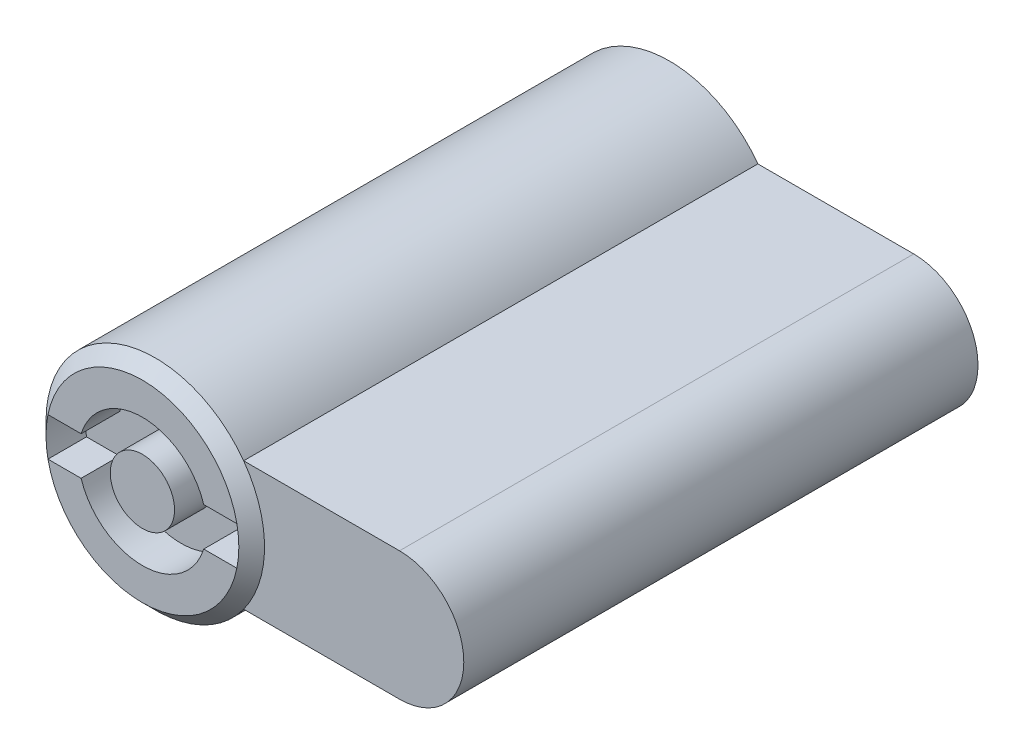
ISO-10303-21;
HEADER;
FILE_DESCRIPTION(('STEP AP214'),'2;1');
FILE_NAME('part.step','',(''),(''),'','','');
FILE_SCHEMA(('AUTOMOTIVE_DESIGN { 1 0 10303 214 1 1 1 1 }'));
ENDSEC;
DATA;
#1=APPLICATION_CONTEXT('core data for automotive mechanical design processes');
#2=APPLICATION_PROTOCOL_DEFINITION('international standard','automotive_design',2000,#1);
#3=PRODUCT_CONTEXT('',#1,'mechanical');
#4=PRODUCT('Part','Part','',(#3));
#5=PRODUCT_RELATED_PRODUCT_CATEGORY('part','',(#4));
#6=PRODUCT_DEFINITION_FORMATION('','',#4);
#7=PRODUCT_DEFINITION_CONTEXT('part definition',#1,'design');
#8=PRODUCT_DEFINITION('design','',#6,#7);
#9=PRODUCT_DEFINITION_SHAPE('','',#8);
#10=(LENGTH_UNIT() NAMED_UNIT(*) SI_UNIT(.MILLI.,.METRE.));
#11=(NAMED_UNIT(*) PLANE_ANGLE_UNIT() SI_UNIT($,.RADIAN.));
#12=(NAMED_UNIT(*) SI_UNIT($,.STERADIAN.) SOLID_ANGLE_UNIT());
#13=UNCERTAINTY_MEASURE_WITH_UNIT(LENGTH_MEASURE(1.E-05),#10,'distance_accuracy_value','');
#14=(GEOMETRIC_REPRESENTATION_CONTEXT(3) GLOBAL_UNCERTAINTY_ASSIGNED_CONTEXT((#13)) GLOBAL_UNIT_ASSIGNED_CONTEXT((#10,
#11,#12)) REPRESENTATION_CONTEXT('',''));
#15=CARTESIAN_POINT('',(0.,0.,0.));
#16=DIRECTION('',(0.,0.,1.));
#17=DIRECTION('',(1.,0.,0.));
#18=AXIS2_PLACEMENT_3D('',#15,#16,#17);
#19=CARTESIAN_POINT('',(0.,0.,1.));
#20=DIRECTION('',(0.,0.,1.));
#21=DIRECTION('',(0.,1.,0.));
#22=AXIS2_PLACEMENT_3D('',#19,#20,#21);
#23=PLANE('',#22);
#24=DIRECTION('',(-1.,0.,0.));
#25=VECTOR('',#24,1.);
#26=CARTESIAN_POINT('',(-4.76969600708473,1.5,1.));
#27=LINE('',#26,#25);
#28=CARTESIAN_POINT('',(-4.76969600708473,1.5,1.));
#29=VERTEX_POINT('',#28);
#30=CARTESIAN_POINT('',(-7.34846922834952,1.5,1.));
#31=VERTEX_POINT('',#30);
#32=EDGE_CURVE('E29',#29,#31,#27,.T.);
#33=ORIENTED_EDGE('',*,*,#32,.F.);
#34=CARTESIAN_POINT('',(0.,0.,1.));
#35=DIRECTION('',(0.,0.,1.));
#36=DIRECTION('',(0.,1.,0.));
#37=AXIS2_PLACEMENT_3D('',#34,#35,#36);
#38=CIRCLE('',#37,5.);
#39=CARTESIAN_POINT('',(4.76969600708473,1.5,1.));
#40=VERTEX_POINT('',#39);
#41=EDGE_CURVE('E200',#40,#29,#38,.T.);
#42=ORIENTED_EDGE('',*,*,#41,.F.);
#43=DIRECTION('',(-1.,0.,0.));
#44=VECTOR('',#43,1.);
#45=CARTESIAN_POINT('',(7.34846922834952,1.5,1.));
#46=LINE('',#45,#44);
#47=CARTESIAN_POINT('',(7.34846922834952,1.5,1.));
#48=VERTEX_POINT('',#47);
#49=EDGE_CURVE('E203',#48,#40,#46,.T.);
#50=ORIENTED_EDGE('',*,*,#49,.F.);
#51=CARTESIAN_POINT('',(0.,0.,1.));
#52=DIRECTION('',(0.,0.,1.));
#53=DIRECTION('',(0.,1.,0.));
#54=AXIS2_PLACEMENT_3D('',#51,#52,#53);
#55=CIRCLE('',#54,7.5);
#56=EDGE_CURVE('E125',#48,#31,#55,.T.);
#57=ORIENTED_EDGE('',*,*,#56,.T.);
#58=EDGE_LOOP('',(#33,#42,#50,#57));
#59=FACE_BOUND('',#58,.T.);
#60=ADVANCED_FACE('F14',(#59),#23,.T.);
#61=CARTESIAN_POINT('',(0.,0.,-40.));
#62=DIRECTION('',(0.,0.,1.));
#63=DIRECTION('',(0.,1.,0.));
#64=AXIS2_PLACEMENT_3D('',#61,#62,#63);
#65=CYLINDRICAL_SURFACE('',#64,8.5);
#66=DIRECTION('',(0.,0.,1.));
#67=VECTOR('',#66,1.);
#68=CARTESIAN_POINT('',(6.87386354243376,-5.,-40.));
#69=LINE('',#68,#67);
#70=CARTESIAN_POINT('',(6.87386354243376,-5.,-40.));
#71=VERTEX_POINT('',#70);
#72=CARTESIAN_POINT('',(6.87386354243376,-5.,0.));
#73=VERTEX_POINT('',#72);
#74=EDGE_CURVE('E146',#71,#73,#69,.T.);
#75=ORIENTED_EDGE('',*,*,#74,.T.);
#76=CARTESIAN_POINT('',(0.,0.,0.));
#77=DIRECTION('',(0.,0.,1.));
#78=DIRECTION('',(0.,1.,0.));
#79=AXIS2_PLACEMENT_3D('',#76,#77,#78);
#80=CIRCLE('',#79,8.5);
#81=CARTESIAN_POINT('',(6.87386354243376,5.,0.));
#82=VERTEX_POINT('',#81);
#83=EDGE_CURVE('E9',#73,#82,#80,.F.);
#84=ORIENTED_EDGE('',*,*,#83,.T.);
#85=DIRECTION('',(0.,0.,1.));
#86=VECTOR('',#85,1.);
#87=CARTESIAN_POINT('',(6.87386354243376,5.,-40.));
#88=LINE('',#87,#86);
#89=CARTESIAN_POINT('',(6.87386354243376,5.,-40.));
#90=VERTEX_POINT('',#89);
#91=EDGE_CURVE('E36',#90,#82,#88,.T.);
#92=ORIENTED_EDGE('',*,*,#91,.F.);
#93=CARTESIAN_POINT('',(0.,0.,-40.));
#94=DIRECTION('',(0.,0.,1.));
#95=DIRECTION('',(0.,1.,0.));
#96=AXIS2_PLACEMENT_3D('',#93,#94,#95);
#97=CIRCLE('',#96,8.5);
#98=EDGE_CURVE('E142',#90,#71,#97,.T.);
#99=ORIENTED_EDGE('',*,*,#98,.T.);
#100=EDGE_LOOP('',(#75,#84,#92,#99));
#101=FACE_BOUND('',#100,.T.);
#102=ADVANCED_FACE('F235',(#101),#65,.T.);
#103=CARTESIAN_POINT('',(6.87386354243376,5.,-40.));
#104=DIRECTION('',(0.,-1.,0.));
#105=DIRECTION('',(1.,0.,0.));
#106=AXIS2_PLACEMENT_3D('',#103,#104,#105);
#107=PLANE('',#106);
#108=DIRECTION('',(0.,0.,1.));
#109=VECTOR('',#108,1.);
#110=CARTESIAN_POINT('',(19.,5.,-40.));
#111=LINE('',#110,#109);
#112=CARTESIAN_POINT('',(19.,5.,-40.));
#113=VERTEX_POINT('',#112);
#114=CARTESIAN_POINT('',(19.,5.,0.));
#115=VERTEX_POINT('',#114);
#116=EDGE_CURVE('E145',#113,#115,#111,.T.);
#117=ORIENTED_EDGE('',*,*,#116,.F.);
#118=DIRECTION('',(1.,0.,0.));
#119=VECTOR('',#118,1.);
#120=CARTESIAN_POINT('',(6.87386354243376,5.,-40.));
#121=LINE('',#120,#119);
#122=EDGE_CURVE('E150',#90,#113,#121,.T.);
#123=ORIENTED_EDGE('',*,*,#122,.F.);
#124=ORIENTED_EDGE('',*,*,#91,.T.);
#125=DIRECTION('',(1.,0.,0.));
#126=VECTOR('',#125,1.);
#127=CARTESIAN_POINT('',(6.87386354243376,5.,0.));
#128=LINE('',#127,#126);
#129=EDGE_CURVE('E139',#82,#115,#128,.T.);
#130=ORIENTED_EDGE('',*,*,#129,.T.);
#131=EDGE_LOOP('',(#117,#123,#124,#130));
#132=FACE_BOUND('',#131,.T.);
#133=ADVANCED_FACE('F16',(#132),#107,.F.);
#134=CARTESIAN_POINT('',(19.,0.,-40.));
#135=DIRECTION('',(0.,0.,1.));
#136=DIRECTION('',(0.,1.,0.));
#137=AXIS2_PLACEMENT_3D('',#134,#135,#136);
#138=CYLINDRICAL_SURFACE('',#137,5.);
#139=DIRECTION('',(0.,0.,1.));
#140=VECTOR('',#139,1.);
#141=CARTESIAN_POINT('',(19.,-5.,-40.));
#142=LINE('',#141,#140);
#143=CARTESIAN_POINT('',(19.,-5.,-40.));
#144=VERTEX_POINT('',#143);
#145=CARTESIAN_POINT('',(19.,-5.,0.));
#146=VERTEX_POINT('',#145);
#147=EDGE_CURVE('E149',#144,#146,#142,.T.);
#148=ORIENTED_EDGE('',*,*,#147,.F.);
#149=CARTESIAN_POINT('',(19.,0.,-40.));
#150=DIRECTION('',(0.,0.,1.));
#151=DIRECTION('',(0.,1.,0.));
#152=AXIS2_PLACEMENT_3D('',#149,#150,#151);
#153=CIRCLE('',#152,5.);
#154=EDGE_CURVE('E161',#144,#113,#153,.T.);
#155=ORIENTED_EDGE('',*,*,#154,.T.);
#156=ORIENTED_EDGE('',*,*,#116,.T.);
#157=CARTESIAN_POINT('',(19.,0.,0.));
#158=DIRECTION('',(0.,0.,1.));
#159=DIRECTION('',(0.,1.,0.));
#160=AXIS2_PLACEMENT_3D('',#157,#158,#159);
#161=CIRCLE('',#160,5.);
#162=EDGE_CURVE('E143',#146,#115,#161,.T.);
#163=ORIENTED_EDGE('',*,*,#162,.F.);
#164=EDGE_LOOP('',(#148,#155,#156,#163));
#165=FACE_BOUND('',#164,.T.);
#166=ADVANCED_FACE('F258',(#165),#138,.T.);
#167=CARTESIAN_POINT('',(6.87386354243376,-5.,-40.));
#168=DIRECTION('',(0.,-1.,0.));
#169=DIRECTION('',(1.,0.,0.));
#170=AXIS2_PLACEMENT_3D('',#167,#168,#169);
#171=PLANE('',#170);
#172=DIRECTION('',(1.,0.,0.));
#173=VECTOR('',#172,1.);
#174=CARTESIAN_POINT('',(6.87386354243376,-5.,-40.));
#175=LINE('',#174,#173);
#176=EDGE_CURVE('E164',#71,#144,#175,.T.);
#177=ORIENTED_EDGE('',*,*,#176,.T.);
#178=ORIENTED_EDGE('',*,*,#147,.T.);
#179=DIRECTION('',(1.,0.,0.));
#180=VECTOR('',#179,1.);
#181=CARTESIAN_POINT('',(6.87386354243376,-5.,0.));
#182=LINE('',#181,#180);
#183=EDGE_CURVE('E151',#73,#146,#182,.T.);
#184=ORIENTED_EDGE('',*,*,#183,.F.);
#185=ORIENTED_EDGE('',*,*,#74,.F.);
#186=EDGE_LOOP('',(#177,#178,#184,#185));
#187=FACE_BOUND('',#186,.T.);
#188=ADVANCED_FACE('F252',(#187),#171,.T.);
#189=CARTESIAN_POINT('',(0.,0.,-40.));
#190=DIRECTION('',(0.,0.,1.));
#191=DIRECTION('',(0.,1.,0.));
#192=AXIS2_PLACEMENT_3D('',#189,#190,#191);
#193=PLANE('',#192);
#194=ORIENTED_EDGE('',*,*,#98,.F.);
#195=ORIENTED_EDGE('',*,*,#122,.T.);
#196=ORIENTED_EDGE('',*,*,#154,.F.);
#197=ORIENTED_EDGE('',*,*,#176,.F.);
#198=EDGE_LOOP('',(#194,#195,#196,#197));
#199=FACE_BOUND('',#198,.T.);
#200=ADVANCED_FACE('F250',(#199),#193,.F.);
#201=CARTESIAN_POINT('',(0.,0.,0.));
#202=DIRECTION('',(0.,0.,1.));
#203=DIRECTION('',(0.,1.,0.));
#204=AXIS2_PLACEMENT_3D('',#201,#202,#203);
#205=PLANE('',#204);
#206=CARTESIAN_POINT('',(0.,0.,0.));
#207=DIRECTION('',(0.,0.,1.));
#208=DIRECTION('',(0.,1.,0.));
#209=AXIS2_PLACEMENT_3D('',#206,#207,#208);
#210=CIRCLE('',#209,8.5);
#211=EDGE_CURVE('E154',#73,#82,#210,.T.);
#212=ORIENTED_EDGE('',*,*,#211,.F.);
#213=ORIENTED_EDGE('',*,*,#183,.T.);
#214=ORIENTED_EDGE('',*,*,#162,.T.);
#215=ORIENTED_EDGE('',*,*,#129,.F.);
#216=EDGE_LOOP('',(#212,#213,#214,#215));
#217=FACE_BOUND('',#216,.T.);
#218=ADVANCED_FACE('F244',(#217),#205,.T.);
#219=DIRECTION('',(1.,0.,0.));
#220=VECTOR('',#219,1.);
#221=CARTESIAN_POINT('',(4.76969600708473,-1.5,1.));
#222=LINE('',#221,#220);
#223=CARTESIAN_POINT('',(4.76969600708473,-1.5,1.));
#224=VERTEX_POINT('',#223);
#225=CARTESIAN_POINT('',(7.34846922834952,-1.5,1.));
#226=VERTEX_POINT('',#225);
#227=EDGE_CURVE('E207',#224,#226,#222,.T.);
#228=ORIENTED_EDGE('',*,*,#227,.F.);
#229=CARTESIAN_POINT('',(-4.76969600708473,-1.5,1.));
#230=VERTEX_POINT('',#229);
#231=EDGE_CURVE('E131',#230,#224,#38,.T.);
#232=ORIENTED_EDGE('',*,*,#231,.F.);
#233=DIRECTION('',(1.,0.,0.));
#234=VECTOR('',#233,1.);
#235=CARTESIAN_POINT('',(-7.34846922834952,-1.5,1.));
#236=LINE('',#235,#234);
#237=CARTESIAN_POINT('',(-7.34846922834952,-1.5,1.));
#238=VERTEX_POINT('',#237);
#239=EDGE_CURVE('E107',#238,#230,#236,.T.);
#240=ORIENTED_EDGE('',*,*,#239,.F.);
#241=EDGE_CURVE('E124',#238,#226,#55,.T.);
#242=ORIENTED_EDGE('',*,*,#241,.T.);
#243=EDGE_LOOP('',(#228,#232,#240,#242));
#244=FACE_BOUND('',#243,.T.);
#245=ADVANCED_FACE('F129',(#244),#23,.T.);
#246=CARTESIAN_POINT('',(0.,0.,1.));
#247=DIRECTION('',(0.,0.,-1.));
#248=DIRECTION('',(0.,-1.,0.));
#249=AXIS2_PLACEMENT_3D('',#246,#247,#248);
#250=CONICAL_SURFACE('',#249,7.5,0.785398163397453);
#251=ORIENTED_EDGE('',*,*,#83,.F.);
#252=ORIENTED_EDGE('',*,*,#211,.T.);
#253=EDGE_LOOP('',(#251,#252));
#254=FACE_BOUND('',#253,.T.);
#255=EDGE_CURVE('E22',#31,#238,#55,.T.);
#256=ORIENTED_EDGE('',*,*,#255,.F.);
#257=ORIENTED_EDGE('',*,*,#56,.F.);
#258=CARTESIAN_POINT('',(0.,0.,1.));
#259=DIRECTION('',(0.,0.,1.));
#260=DIRECTION('',(0.,1.,0.));
#261=AXIS2_PLACEMENT_3D('',#258,#259,#260);
#262=CIRCLE('',#261,7.5);
#263=EDGE_CURVE('E137',#226,#48,#262,.T.);
#264=ORIENTED_EDGE('',*,*,#263,.F.);
#265=ORIENTED_EDGE('',*,*,#241,.F.);
#266=EDGE_LOOP('',(#256,#257,#264,#265));
#267=FACE_BOUND('',#266,.T.);
#268=ADVANCED_FACE('F135',(#254,#267),#250,.T.);
#269=CARTESIAN_POINT('',(0.,0.,-2.));
#270=DIRECTION('',(0.,0.,1.));
#271=DIRECTION('',(0.,1.,0.));
#272=AXIS2_PLACEMENT_3D('',#269,#270,#271);
#273=CYLINDRICAL_SURFACE('',#272,7.5);
#274=DIRECTION('',(0.,0.,1.));
#275=VECTOR('',#274,1.);
#276=CARTESIAN_POINT('',(-7.34846922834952,1.5,-2.));
#277=LINE('',#276,#275);
#278=CARTESIAN_POINT('',(-7.34846922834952,1.5,-2.));
#279=VERTEX_POINT('',#278);
#280=EDGE_CURVE('E119',#279,#31,#277,.T.);
#281=ORIENTED_EDGE('',*,*,#280,.T.);
#282=ORIENTED_EDGE('',*,*,#255,.T.);
#283=DIRECTION('',(0.,0.,1.));
#284=VECTOR('',#283,1.);
#285=CARTESIAN_POINT('',(-7.34846922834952,-1.5,-2.));
#286=LINE('',#285,#284);
#287=CARTESIAN_POINT('',(-7.34846922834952,-1.5,-2.));
#288=VERTEX_POINT('',#287);
#289=EDGE_CURVE('E103',#288,#238,#286,.T.);
#290=ORIENTED_EDGE('',*,*,#289,.F.);
#291=CARTESIAN_POINT('',(0.,0.,-2.));
#292=DIRECTION('',(0.,0.,1.));
#293=DIRECTION('',(0.,1.,0.));
#294=AXIS2_PLACEMENT_3D('',#291,#292,#293);
#295=CIRCLE('',#294,7.5);
#296=EDGE_CURVE('E195',#279,#288,#295,.T.);
#297=ORIENTED_EDGE('',*,*,#296,.F.);
#298=EDGE_LOOP('',(#281,#282,#290,#297));
#299=FACE_BOUND('',#298,.T.);
#300=ADVANCED_FACE('F118',(#299),#273,.F.);
#301=CARTESIAN_POINT('',(-4.76969600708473,1.5,-2.));
#302=DIRECTION('',(0.,1.,0.));
#303=DIRECTION('',(0.,0.,-1.));
#304=AXIS2_PLACEMENT_3D('',#301,#302,#303);
#305=PLANE('',#304);
#306=DIRECTION('',(0.,0.,1.));
#307=VECTOR('',#306,1.);
#308=CARTESIAN_POINT('',(-4.76969600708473,1.5,-2.));
#309=LINE('',#308,#307);
#310=CARTESIAN_POINT('',(-4.76969600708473,1.5,-2.));
#311=VERTEX_POINT('',#310);
#312=EDGE_CURVE('E171',#311,#29,#309,.T.);
#313=ORIENTED_EDGE('',*,*,#312,.T.);
#314=ORIENTED_EDGE('',*,*,#32,.T.);
#315=ORIENTED_EDGE('',*,*,#280,.F.);
#316=DIRECTION('',(-1.,0.,0.));
#317=VECTOR('',#316,1.);
#318=CARTESIAN_POINT('',(-4.76969600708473,1.5,-2.));
#319=LINE('',#318,#317);
#320=EDGE_CURVE('E115',#311,#279,#319,.T.);
#321=ORIENTED_EDGE('',*,*,#320,.F.);
#322=EDGE_LOOP('',(#313,#314,#315,#321));
#323=FACE_BOUND('',#322,.T.);
#324=ADVANCED_FACE('F324',(#323),#305,.F.);
#325=CARTESIAN_POINT('',(0.,0.,-2.));
#326=DIRECTION('',(0.,0.,1.));
#327=DIRECTION('',(0.,1.,0.));
#328=AXIS2_PLACEMENT_3D('',#325,#326,#327);
#329=CYLINDRICAL_SURFACE('',#328,5.);
#330=DIRECTION('',(0.,0.,1.));
#331=VECTOR('',#330,1.);
#332=CARTESIAN_POINT('',(4.76969600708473,1.5,-2.));
#333=LINE('',#332,#331);
#334=CARTESIAN_POINT('',(4.76969600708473,1.5,-2.));
#335=VERTEX_POINT('',#334);
#336=EDGE_CURVE('E173',#335,#40,#333,.T.);
#337=ORIENTED_EDGE('',*,*,#336,.T.);
#338=ORIENTED_EDGE('',*,*,#41,.T.);
#339=ORIENTED_EDGE('',*,*,#312,.F.);
#340=CARTESIAN_POINT('',(0.,0.,-2.));
#341=DIRECTION('',(0.,0.,1.));
#342=DIRECTION('',(0.,1.,0.));
#343=AXIS2_PLACEMENT_3D('',#340,#341,#342);
#344=CIRCLE('',#343,5.);
#345=EDGE_CURVE('E184',#335,#311,#344,.T.);
#346=ORIENTED_EDGE('',*,*,#345,.F.);
#347=EDGE_LOOP('',(#337,#338,#339,#346));
#348=FACE_BOUND('',#347,.T.);
#349=ADVANCED_FACE('F334',(#348),#329,.F.);
#350=CARTESIAN_POINT('',(7.34846922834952,1.5,-2.));
#351=DIRECTION('',(0.,1.,0.));
#352=DIRECTION('',(0.,0.,-1.));
#353=AXIS2_PLACEMENT_3D('',#350,#351,#352);
#354=PLANE('',#353);
#355=DIRECTION('',(0.,0.,1.));
#356=VECTOR('',#355,1.);
#357=CARTESIAN_POINT('',(7.34846922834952,1.5,-2.));
#358=LINE('',#357,#356);
#359=CARTESIAN_POINT('',(7.34846922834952,1.5,-2.));
#360=VERTEX_POINT('',#359);
#361=EDGE_CURVE('E175',#360,#48,#358,.T.);
#362=ORIENTED_EDGE('',*,*,#361,.T.);
#363=ORIENTED_EDGE('',*,*,#49,.T.);
#364=ORIENTED_EDGE('',*,*,#336,.F.);
#365=DIRECTION('',(-1.,0.,0.));
#366=VECTOR('',#365,1.);
#367=CARTESIAN_POINT('',(7.34846922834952,1.5,-2.));
#368=LINE('',#367,#366);
#369=EDGE_CURVE('E187',#360,#335,#368,.T.);
#370=ORIENTED_EDGE('',*,*,#369,.F.);
#371=EDGE_LOOP('',(#362,#363,#364,#370));
#372=FACE_BOUND('',#371,.T.);
#373=ADVANCED_FACE('F343',(#372),#354,.F.);
#374=DIRECTION('',(0.,0.,1.));
#375=VECTOR('',#374,1.);
#376=CARTESIAN_POINT('',(7.34846922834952,-1.5,-2.));
#377=LINE('',#376,#375);
#378=CARTESIAN_POINT('',(7.34846922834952,-1.5,-2.));
#379=VERTEX_POINT('',#378);
#380=EDGE_CURVE('E177',#379,#226,#377,.T.);
#381=ORIENTED_EDGE('',*,*,#380,.T.);
#382=ORIENTED_EDGE('',*,*,#263,.T.);
#383=ORIENTED_EDGE('',*,*,#361,.F.);
#384=EDGE_CURVE('E191',#379,#360,#295,.T.);
#385=ORIENTED_EDGE('',*,*,#384,.F.);
#386=EDGE_LOOP('',(#381,#382,#383,#385));
#387=FACE_BOUND('',#386,.T.);
#388=ADVANCED_FACE('F326',(#387),#273,.F.);
#389=CARTESIAN_POINT('',(4.76969600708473,-1.5,-2.));
#390=DIRECTION('',(0.,-1.,0.));
#391=DIRECTION('',(1.,0.,0.));
#392=AXIS2_PLACEMENT_3D('',#389,#390,#391);
#393=PLANE('',#392);
#394=DIRECTION('',(0.,0.,1.));
#395=VECTOR('',#394,1.);
#396=CARTESIAN_POINT('',(4.76969600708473,-1.5,-2.));
#397=LINE('',#396,#395);
#398=CARTESIAN_POINT('',(4.76969600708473,-1.5,-2.));
#399=VERTEX_POINT('',#398);
#400=EDGE_CURVE('E179',#399,#224,#397,.T.);
#401=ORIENTED_EDGE('',*,*,#400,.T.);
#402=ORIENTED_EDGE('',*,*,#227,.T.);
#403=ORIENTED_EDGE('',*,*,#380,.F.);
#404=DIRECTION('',(1.,0.,0.));
#405=VECTOR('',#404,1.);
#406=CARTESIAN_POINT('',(4.76969600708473,-1.5,-2.));
#407=LINE('',#406,#405);
#408=EDGE_CURVE('E194',#399,#379,#407,.T.);
#409=ORIENTED_EDGE('',*,*,#408,.F.);
#410=EDGE_LOOP('',(#401,#402,#403,#409));
#411=FACE_BOUND('',#410,.T.);
#412=ADVANCED_FACE('F362',(#411),#393,.F.);
#413=DIRECTION('',(0.,0.,1.));
#414=VECTOR('',#413,1.);
#415=CARTESIAN_POINT('',(-4.76969600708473,-1.5,-2.));
#416=LINE('',#415,#414);
#417=CARTESIAN_POINT('',(-4.76969600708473,-1.5,-2.));
#418=VERTEX_POINT('',#417);
#419=EDGE_CURVE('E114',#418,#230,#416,.T.);
#420=ORIENTED_EDGE('',*,*,#419,.T.);
#421=ORIENTED_EDGE('',*,*,#231,.T.);
#422=ORIENTED_EDGE('',*,*,#400,.F.);
#423=EDGE_CURVE('E188',#418,#399,#344,.T.);
#424=ORIENTED_EDGE('',*,*,#423,.F.);
#425=EDGE_LOOP('',(#420,#421,#422,#424));
#426=FACE_BOUND('',#425,.T.);
#427=ADVANCED_FACE('F231',(#426),#329,.F.);
#428=CARTESIAN_POINT('',(-7.34846922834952,-1.5,-2.));
#429=DIRECTION('',(0.,-1.,0.));
#430=DIRECTION('',(1.,0.,0.));
#431=AXIS2_PLACEMENT_3D('',#428,#429,#430);
#432=PLANE('',#431);
#433=DIRECTION('',(1.,0.,0.));
#434=VECTOR('',#433,1.);
#435=CARTESIAN_POINT('',(-7.34846922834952,-1.5,-2.));
#436=LINE('',#435,#434);
#437=EDGE_CURVE('E110',#288,#418,#436,.T.);
#438=ORIENTED_EDGE('',*,*,#437,.F.);
#439=ORIENTED_EDGE('',*,*,#289,.T.);
#440=ORIENTED_EDGE('',*,*,#239,.T.);
#441=ORIENTED_EDGE('',*,*,#419,.F.);
#442=EDGE_LOOP('',(#438,#439,#440,#441));
#443=FACE_BOUND('',#442,.T.);
#444=ADVANCED_FACE('F105',(#443),#432,.F.);
#445=CARTESIAN_POINT('',(0.,0.,-2.));
#446=DIRECTION('',(0.,0.,1.));
#447=DIRECTION('',(0.,1.,0.));
#448=AXIS2_PLACEMENT_3D('',#445,#446,#447);
#449=PLANE('',#448);
#450=CARTESIAN_POINT('',(0.,0.,-2.));
#451=DIRECTION('',(0.,0.,1.));
#452=DIRECTION('',(0.,1.,0.));
#453=AXIS2_PLACEMENT_3D('',#450,#451,#452);
#454=CIRCLE('',#453,2.5);
#455=CARTESIAN_POINT('',(0.,2.5,-2.));
#456=VERTEX_POINT('',#455);
#457=EDGE_CURVE('E132',#456,#456,#454,.T.);
#458=ORIENTED_EDGE('',*,*,#457,.F.);
#459=EDGE_LOOP('',(#458));
#460=FACE_BOUND('',#459,.T.);
#461=ORIENTED_EDGE('',*,*,#296,.T.);
#462=ORIENTED_EDGE('',*,*,#437,.T.);
#463=ORIENTED_EDGE('',*,*,#423,.T.);
#464=ORIENTED_EDGE('',*,*,#408,.T.);
#465=ORIENTED_EDGE('',*,*,#384,.T.);
#466=ORIENTED_EDGE('',*,*,#369,.T.);
#467=ORIENTED_EDGE('',*,*,#345,.T.);
#468=ORIENTED_EDGE('',*,*,#320,.T.);
#469=EDGE_LOOP('',(#461,#462,#463,#464,#465,#466,#467,#468));
#470=FACE_BOUND('',#469,.T.);
#471=ADVANCED_FACE('F220',(#460,#470),#449,.T.);
#472=CARTESIAN_POINT('',(0.,0.,-2.));
#473=DIRECTION('',(0.,0.,1.));
#474=DIRECTION('',(0.,1.,0.));
#475=AXIS2_PLACEMENT_3D('',#472,#473,#474);
#476=CYLINDRICAL_SURFACE('',#475,2.5);
#477=ORIENTED_EDGE('',*,*,#457,.T.);
#478=EDGE_LOOP('',(#477));
#479=FACE_BOUND('',#478,.T.);
#480=CARTESIAN_POINT('',(0.,0.,1.));
#481=DIRECTION('',(0.,0.,1.));
#482=DIRECTION('',(0.,1.,0.));
#483=AXIS2_PLACEMENT_3D('',#480,#481,#482);
#484=CIRCLE('',#483,2.5);
#485=CARTESIAN_POINT('',(0.,2.5,1.));
#486=VERTEX_POINT('',#485);
#487=EDGE_CURVE('E212',#486,#486,#484,.T.);
#488=ORIENTED_EDGE('',*,*,#487,.F.);
#489=EDGE_LOOP('',(#488));
#490=FACE_BOUND('',#489,.T.);
#491=ADVANCED_FACE('F218',(#479,#490),#476,.T.);
#492=ORIENTED_EDGE('',*,*,#487,.T.);
#493=EDGE_LOOP('',(#492));
#494=FACE_BOUND('',#493,.T.);
#495=ADVANCED_FACE('F216',(#494),#23,.T.);
#496=CLOSED_SHELL('',(#60,#102,#133,#166,#188,#200,#218,#245,#268,#300,#324,#349,#373,#388,#412,
#427,#444,#471,#491,#495));
#497=MANIFOLD_SOLID_BREP('B1',#496);
#498=ADVANCED_BREP_SHAPE_REPRESENTATION('',(#18,#497),#14);
#499=SHAPE_DEFINITION_REPRESENTATION(#9,#498);
ENDSEC;
END-ISO-10303-21;
